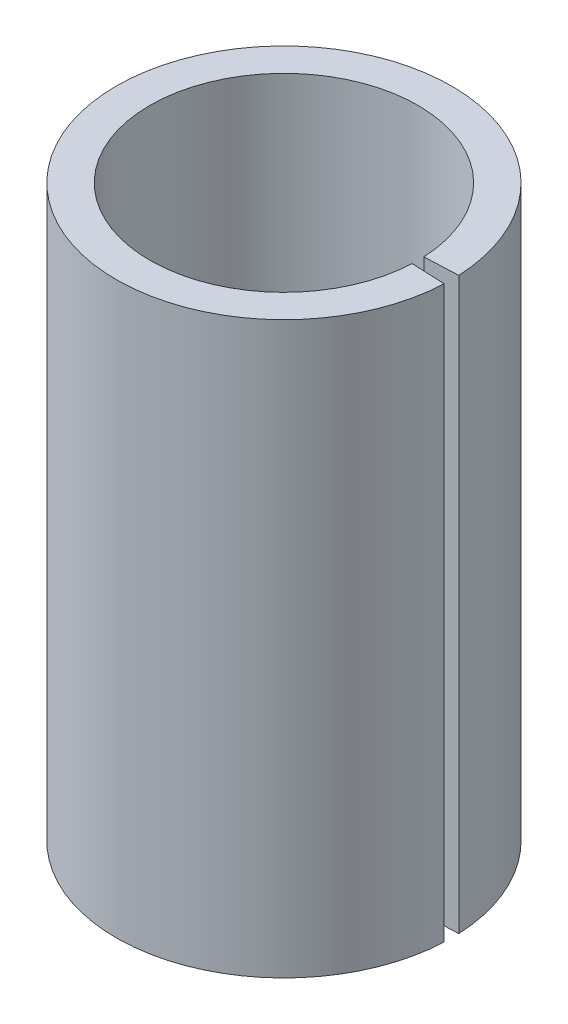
ISO-10303-21;
HEADER;
FILE_DESCRIPTION(('STEP AP214'),'2;1');
FILE_NAME('part.step','',(''),(''),'','','');
FILE_SCHEMA(('AUTOMOTIVE_DESIGN { 1 0 10303 214 1 1 1 1 }'));
ENDSEC;
DATA;
#1=APPLICATION_CONTEXT('core data for automotive mechanical design processes');
#2=APPLICATION_PROTOCOL_DEFINITION('international standard','automotive_design',2000,#1);
#3=PRODUCT_CONTEXT('',#1,'mechanical');
#4=PRODUCT('Part','Part','',(#3));
#5=PRODUCT_RELATED_PRODUCT_CATEGORY('part','',(#4));
#6=PRODUCT_DEFINITION_FORMATION('','',#4);
#7=PRODUCT_DEFINITION_CONTEXT('part definition',#1,'design');
#8=PRODUCT_DEFINITION('design','',#6,#7);
#9=PRODUCT_DEFINITION_SHAPE('','',#8);
#10=(LENGTH_UNIT() NAMED_UNIT(*) SI_UNIT(.MILLI.,.METRE.));
#11=(NAMED_UNIT(*) PLANE_ANGLE_UNIT() SI_UNIT($,.RADIAN.));
#12=(NAMED_UNIT(*) SI_UNIT($,.STERADIAN.) SOLID_ANGLE_UNIT());
#13=UNCERTAINTY_MEASURE_WITH_UNIT(LENGTH_MEASURE(1.E-05),#10,'distance_accuracy_value','');
#14=(GEOMETRIC_REPRESENTATION_CONTEXT(3) GLOBAL_UNCERTAINTY_ASSIGNED_CONTEXT((#13)) GLOBAL_UNIT_ASSIGNED_CONTEXT((#10,
#11,#12)) REPRESENTATION_CONTEXT('',''));
#15=CARTESIAN_POINT('',(0.,0.,0.));
#16=DIRECTION('',(0.,0.,1.));
#17=DIRECTION('',(1.,0.,0.));
#18=AXIS2_PLACEMENT_3D('',#15,#16,#17);
#19=CARTESIAN_POINT('',(0.,8.636,0.));
#20=DIRECTION('',(0.,-1.,0.));
#21=DIRECTION('',(0.,0.,-1.));
#22=AXIS2_PLACEMENT_3D('',#19,#20,#21);
#23=CYLINDRICAL_SURFACE('',#22,2.54);
#24=CARTESIAN_POINT('',(0.,0.,0.));
#25=DIRECTION('',(0.,1.,0.));
#26=DIRECTION('',(0.,0.,1.));
#27=AXIS2_PLACEMENT_3D('',#24,#25,#26);
#28=CIRCLE('',#27,2.54);
#29=CARTESIAN_POINT('',(2.53758248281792,0.,-0.110793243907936));
#30=VERTEX_POINT('',#29);
#31=CARTESIAN_POINT('',(2.53758248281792,0.,0.110793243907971));
#32=VERTEX_POINT('',#31);
#33=EDGE_CURVE('E87',#30,#32,#28,.T.);
#34=ORIENTED_EDGE('',*,*,#33,.T.);
#35=DIRECTION('',(0.,-1.,0.));
#36=VECTOR('',#35,1.);
#37=CARTESIAN_POINT('',(2.53758248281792,8.636,0.110793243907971));
#38=LINE('',#37,#36);
#39=CARTESIAN_POINT('',(2.53758248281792,8.636,0.110793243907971));
#40=VERTEX_POINT('',#39);
#41=EDGE_CURVE('E13',#40,#32,#38,.T.);
#42=ORIENTED_EDGE('',*,*,#41,.F.);
#43=CARTESIAN_POINT('',(0.,8.636,0.));
#44=DIRECTION('',(0.,1.,0.));
#45=DIRECTION('',(0.,0.,1.));
#46=AXIS2_PLACEMENT_3D('',#43,#44,#45);
#47=CIRCLE('',#46,2.54);
#48=CARTESIAN_POINT('',(2.53758248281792,8.636,-0.110793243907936));
#49=VERTEX_POINT('',#48);
#50=EDGE_CURVE('E105',#49,#40,#47,.T.);
#51=ORIENTED_EDGE('',*,*,#50,.F.);
#52=DIRECTION('',(0.,-1.,0.));
#53=VECTOR('',#52,1.);
#54=CARTESIAN_POINT('',(2.53758248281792,8.636,-0.110793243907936));
#55=LINE('',#54,#53);
#56=EDGE_CURVE('E99',#49,#30,#55,.T.);
#57=ORIENTED_EDGE('',*,*,#56,.T.);
#58=EDGE_LOOP('',(#34,#42,#51,#57));
#59=FACE_BOUND('',#58,.T.);
#60=ADVANCED_FACE('F43',(#59),#23,.T.);
#61=CARTESIAN_POINT('',(2.53758248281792,8.636,0.110793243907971));
#62=DIRECTION('',(-0.043619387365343,0.,0.999048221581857));
#63=DIRECTION('',(0.999048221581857,0.,0.043619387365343));
#64=AXIS2_PLACEMENT_3D('',#61,#62,#63);
#65=PLANE('',#64);
#66=DIRECTION('',(-0.999048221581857,0.,-0.043619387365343));
#67=VECTOR('',#66,1.);
#68=CARTESIAN_POINT('',(2.53758248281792,0.,0.110793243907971));
#69=LINE('',#68,#67);
#70=CARTESIAN_POINT('',(2.03006598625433,0.,0.0886345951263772));
#71=VERTEX_POINT('',#70);
#72=EDGE_CURVE('E83',#32,#71,#69,.T.);
#73=ORIENTED_EDGE('',*,*,#72,.T.);
#74=DIRECTION('',(0.,-1.,0.));
#75=VECTOR('',#74,1.);
#76=CARTESIAN_POINT('',(2.03006598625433,8.636,0.0886345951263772));
#77=LINE('',#76,#75);
#78=CARTESIAN_POINT('',(2.03006598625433,8.636,0.0886345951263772));
#79=VERTEX_POINT('',#78);
#80=EDGE_CURVE('E50',#79,#71,#77,.T.);
#81=ORIENTED_EDGE('',*,*,#80,.F.);
#82=DIRECTION('',(-0.999048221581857,0.,-0.043619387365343));
#83=VECTOR('',#82,1.);
#84=CARTESIAN_POINT('',(2.53758248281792,8.636,0.110793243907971));
#85=LINE('',#84,#83);
#86=EDGE_CURVE('E95',#40,#79,#85,.T.);
#87=ORIENTED_EDGE('',*,*,#86,.F.);
#88=ORIENTED_EDGE('',*,*,#41,.T.);
#89=EDGE_LOOP('',(#73,#81,#87,#88));
#90=FACE_BOUND('',#89,.T.);
#91=ADVANCED_FACE('F94',(#90),#65,.F.);
#92=CARTESIAN_POINT('',(0.,8.636,0.));
#93=DIRECTION('',(0.,-1.,0.));
#94=DIRECTION('',(0.,0.,-1.));
#95=AXIS2_PLACEMENT_3D('',#92,#93,#94);
#96=CYLINDRICAL_SURFACE('',#95,2.032);
#97=CARTESIAN_POINT('',(0.,0.,0.));
#98=DIRECTION('',(0.,-1.,0.));
#99=DIRECTION('',(0.,0.,1.));
#100=AXIS2_PLACEMENT_3D('',#97,#98,#99);
#101=CIRCLE('',#100,2.032);
#102=CARTESIAN_POINT('',(2.03006598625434,0.,-0.0886345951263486));
#103=VERTEX_POINT('',#102);
#104=EDGE_CURVE('E88',#71,#103,#101,.T.);
#105=ORIENTED_EDGE('',*,*,#104,.T.);
#106=DIRECTION('',(0.,-1.,0.));
#107=VECTOR('',#106,1.);
#108=CARTESIAN_POINT('',(2.03006598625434,8.636,-0.0886345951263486));
#109=LINE('',#108,#107);
#110=CARTESIAN_POINT('',(2.03006598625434,8.636,-0.0886345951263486));
#111=VERTEX_POINT('',#110);
#112=EDGE_CURVE('E111',#111,#103,#109,.T.);
#113=ORIENTED_EDGE('',*,*,#112,.F.);
#114=CARTESIAN_POINT('',(0.,8.636,0.));
#115=DIRECTION('',(0.,-1.,0.));
#116=DIRECTION('',(0.,0.,1.));
#117=AXIS2_PLACEMENT_3D('',#114,#115,#116);
#118=CIRCLE('',#117,2.032);
#119=EDGE_CURVE('E62',#79,#111,#118,.T.);
#120=ORIENTED_EDGE('',*,*,#119,.F.);
#121=ORIENTED_EDGE('',*,*,#80,.T.);
#122=EDGE_LOOP('',(#105,#113,#120,#121));
#123=FACE_BOUND('',#122,.T.);
#124=ADVANCED_FACE('F114',(#123),#96,.F.);
#125=CARTESIAN_POINT('',(2.53758248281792,8.636,-0.110793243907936));
#126=DIRECTION('',(-0.0436193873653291,0.,-0.999048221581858));
#127=DIRECTION('',(-0.999048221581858,0.,0.0436193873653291));
#128=AXIS2_PLACEMENT_3D('',#125,#126,#127);
#129=PLANE('',#128);
#130=DIRECTION('',(0.999048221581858,0.,-0.0436193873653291));
#131=VECTOR('',#130,1.);
#132=CARTESIAN_POINT('',(2.53758248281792,0.,-0.110793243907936));
#133=LINE('',#132,#131);
#134=EDGE_CURVE('E103',#103,#30,#133,.T.);
#135=ORIENTED_EDGE('',*,*,#134,.T.);
#136=ORIENTED_EDGE('',*,*,#56,.F.);
#137=DIRECTION('',(0.999048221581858,0.,-0.0436193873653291));
#138=VECTOR('',#137,1.);
#139=CARTESIAN_POINT('',(2.53758248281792,8.636,-0.110793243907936));
#140=LINE('',#139,#138);
#141=EDGE_CURVE('E57',#111,#49,#140,.T.);
#142=ORIENTED_EDGE('',*,*,#141,.F.);
#143=ORIENTED_EDGE('',*,*,#112,.T.);
#144=EDGE_LOOP('',(#135,#136,#142,#143));
#145=FACE_BOUND('',#144,.T.);
#146=ADVANCED_FACE('F116',(#145),#129,.F.);
#147=CARTESIAN_POINT('',(0.,8.636,0.));
#148=DIRECTION('',(0.,1.,0.));
#149=DIRECTION('',(0.,0.,1.));
#150=AXIS2_PLACEMENT_3D('',#147,#148,#149);
#151=PLANE('',#150);
#152=ORIENTED_EDGE('',*,*,#50,.T.);
#153=ORIENTED_EDGE('',*,*,#86,.T.);
#154=ORIENTED_EDGE('',*,*,#119,.T.);
#155=ORIENTED_EDGE('',*,*,#141,.T.);
#156=EDGE_LOOP('',(#152,#153,#154,#155));
#157=FACE_BOUND('',#156,.T.);
#158=ADVANCED_FACE('F117',(#157),#151,.T.);
#159=CARTESIAN_POINT('',(0.,0.,0.));
#160=DIRECTION('',(0.,1.,0.));
#161=DIRECTION('',(0.,0.,1.));
#162=AXIS2_PLACEMENT_3D('',#159,#160,#161);
#163=PLANE('',#162);
#164=ORIENTED_EDGE('',*,*,#33,.F.);
#165=ORIENTED_EDGE('',*,*,#134,.F.);
#166=ORIENTED_EDGE('',*,*,#104,.F.);
#167=ORIENTED_EDGE('',*,*,#72,.F.);
#168=EDGE_LOOP('',(#164,#165,#166,#167));
#169=FACE_BOUND('',#168,.T.);
#170=ADVANCED_FACE('F84',(#169),#163,.F.);
#171=CLOSED_SHELL('',(#60,#91,#124,#146,#158,#170));
#172=MANIFOLD_SOLID_BREP('B2',#171);
#173=ADVANCED_BREP_SHAPE_REPRESENTATION('',(#18,#172),#14);
#174=SHAPE_DEFINITION_REPRESENTATION(#9,#173);
ENDSEC;
END-ISO-10303-21;
